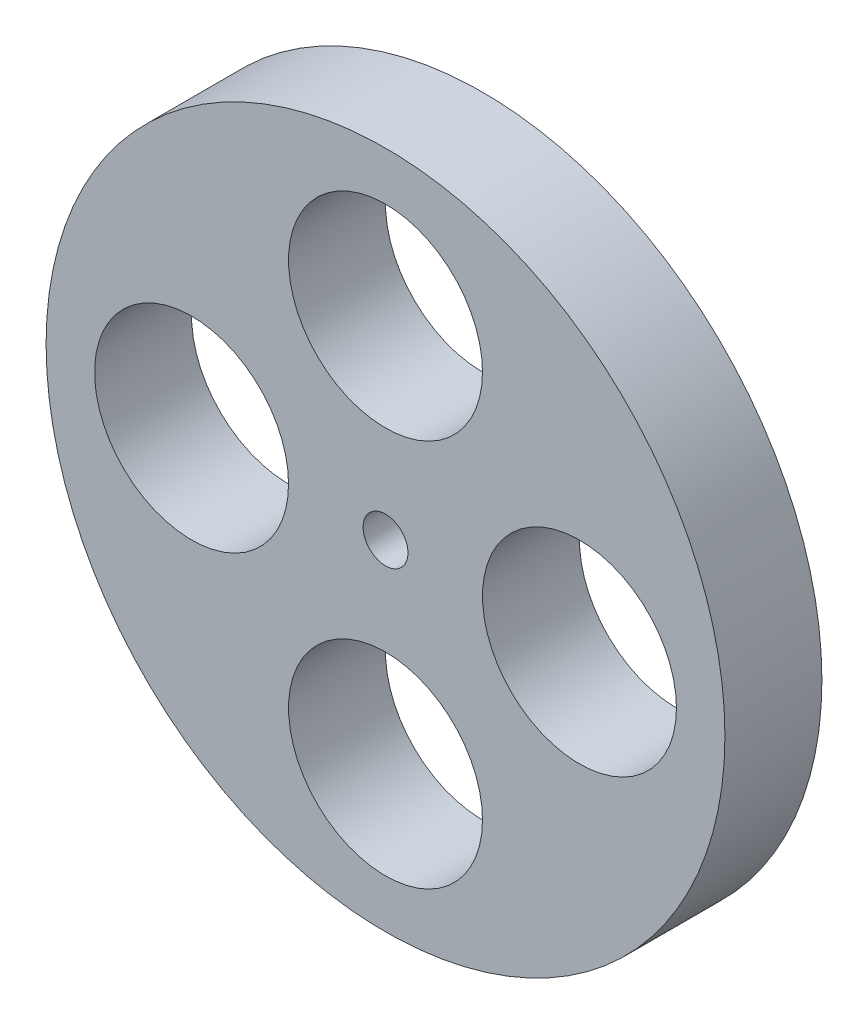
from build123d import *

# Parameters (mm, degrees)
SKETCH1_R           = 44.45
SKETCH1_R_2         = 2.936499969
SKETCH1_R_3         = 12.7
BOSS_EXTRUDE1_DEPTH = 12.7


with BuildPart() as part:
    # Sketch1 → Boss-Extrude1 (new body)
    with BuildSketch(Plane.XY):
        Circle(SKETCH1_R)
        Circle(SKETCH1_R_2, mode=Mode.SUBTRACT)
        with Locations((0, 25.4)):
            Circle(SKETCH1_R_3, mode=Mode.SUBTRACT)
        with Locations((25.4, 0)):
            Circle(SKETCH1_R_3, mode=Mode.SUBTRACT)
        with Locations((0, -25.4)):
            Circle(SKETCH1_R_3, mode=Mode.SUBTRACT)
        with Locations((-25.4, 0)):
            Circle(SKETCH1_R_3, mode=Mode.SUBTRACT)
    extrude(amount=BOSS_EXTRUDE1_DEPTH)


solid = part.part
